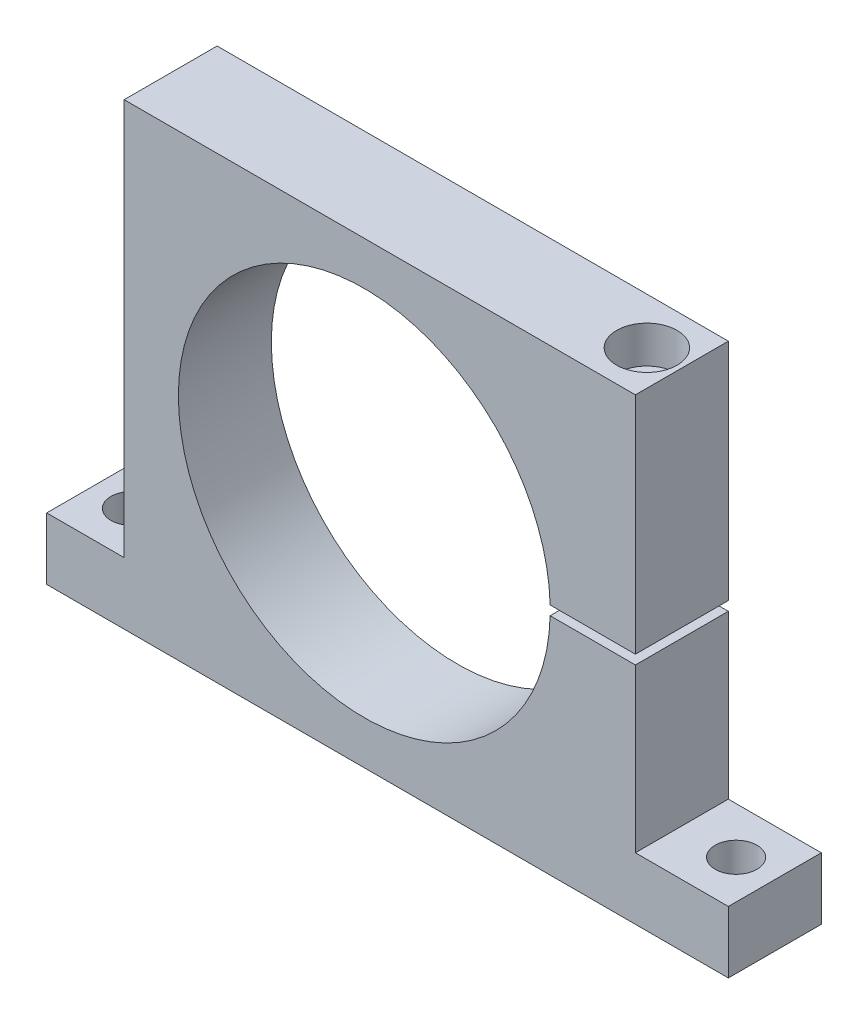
from build123d import *

# Parameters (mm, degrees)
BOSS_EXTRUDE1_DEPTH = 15
SKETCH2_R           = 6.75
CUT_EXTRUDE1_DEPTH  = 20


with BuildPart() as part:
    # Sketch1 → Boss-Extrude1 (new, symmetric)
    with BuildSketch(Plane.XY):
        with BuildLine():
            Line((-77.5, 74), (87.5, 74))
            Line((87.5, 74), (87.5, 1.5))
            Line((87.5, 1.5), (59.981247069, 1.5))
            ThreePointArc((59.981247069, 1.5), (-60, 0), (59.981247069, -1.5))
            Line((59.981247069, -1.5), (87.5, -1.5))
            Line((87.5, -1.5), (87.5, -54))
            Line((87.5, -54), (117.5, -54))
            Line((117.5, -54), (117.5, -74))
            Line((117.5, -74), (-102.5, -74))
            Line((-102.5, -74), (-102.5, -54))
            Line((-102.5, -54), (-77.5, -54))
            Line((-77.5, -54), (-77.5, 74))
        make_face()
    extrude(amount=BOSS_EXTRUDE1_DEPTH, both=True)

    # Sketch2 → Cut-Extrude1 (cut)
    with BuildSketch(Plane.XZ.offset(74)):
        with Locations((-90, 0)):
            Circle(SKETCH2_R)
        with Locations((105, 0)):
            Circle(SKETCH2_R)
    extrude(amount=-CUT_EXTRUDE1_DEPTH, mode=Mode.SUBTRACT)

    # Sketch3 → Cut-Revolve1 (revolve, cut)
    with BuildSketch(Plane.XY, mode=Mode.PRIVATE) as cut_revolve1_sk:
        Polygon((76.2, 74), (85.95, 74), (85.95, 62), (82.2, 62), (82.2, -46), (76.2, -49.605163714), align=None)
    revolve(cut_revolve1_sk.sketch.rotate(Axis((76.2, 74, 0), (0, -1, 0)), 180), axis=Axis((76.2, 74, 0), (0, -1, 0)), mode=Mode.SUBTRACT)


solid = part.part
